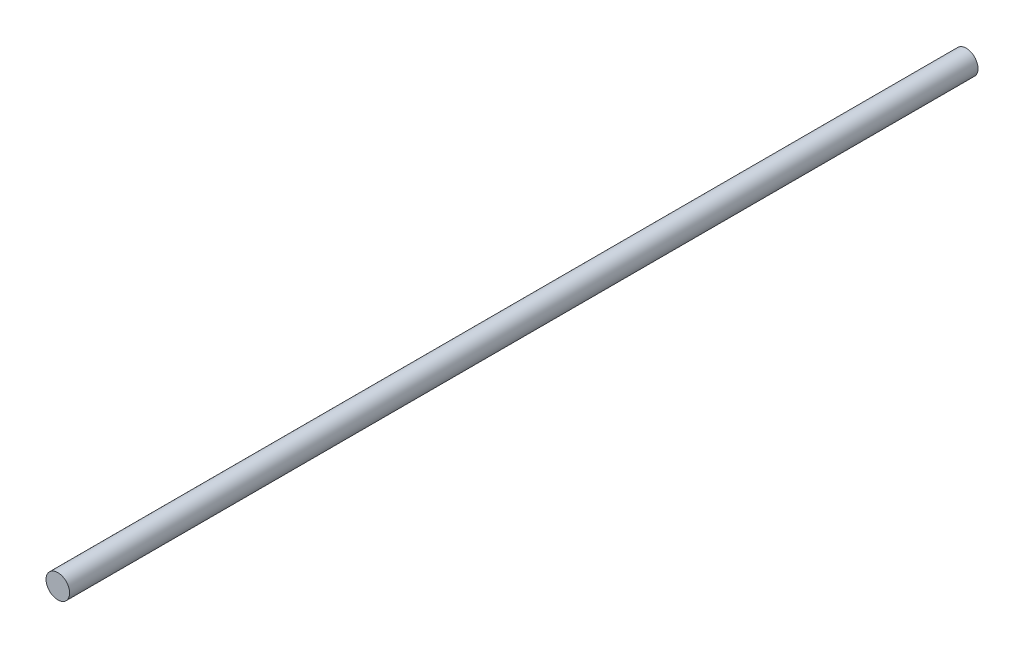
from build123d import *

# Parameters (mm, degrees)
SKETCH_1_R      = 3.175
EXTRUDE_1_DEPTH = 244


with BuildPart() as part:
    # Sketch 1 → Extrude 1 (new body)
    with BuildSketch(Plane.XY):
        with Locations(Location((0, 0, 0), (0, 0, 180))):
            Circle(SKETCH_1_R)
    extrude(amount=EXTRUDE_1_DEPTH)


solid = part.part
